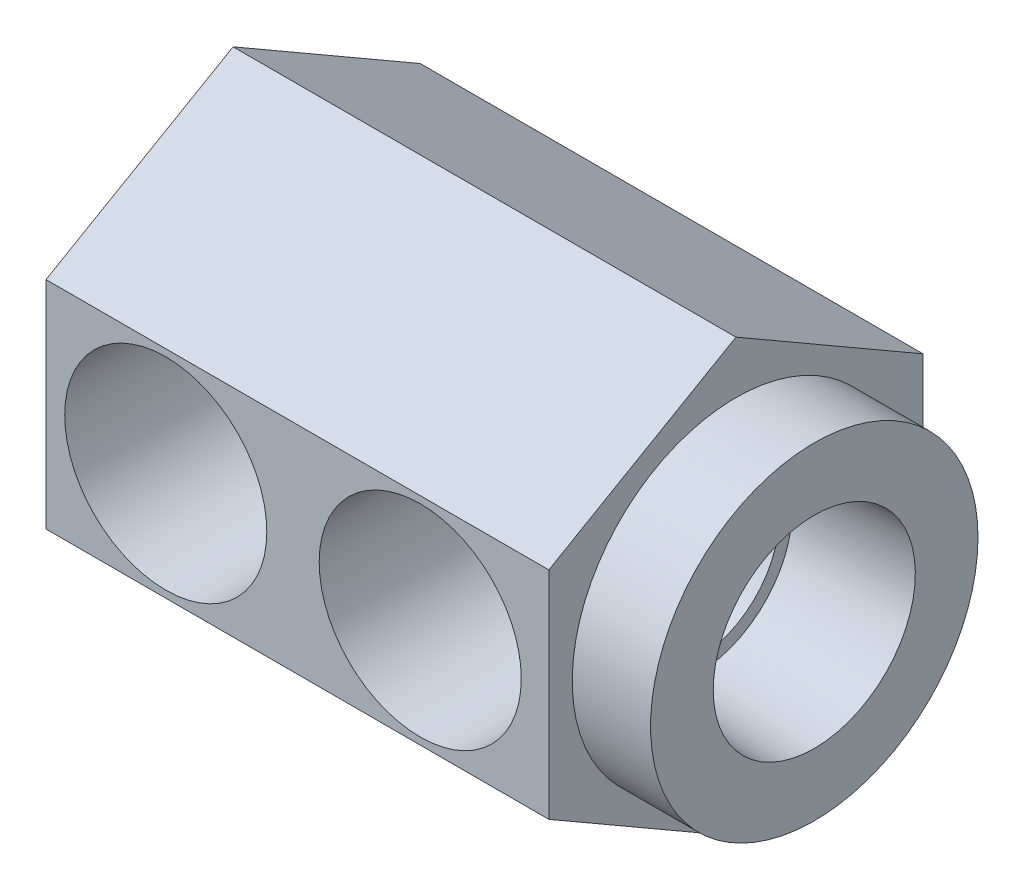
from build123d import *

# Parameters (mm, degrees)
BOSS_EXTRUDE1_DEPTH                 = 34.13125
SKETCH3_R                           = 11.1125
BOSS_EXTRUDE2_DEPTH                 = 5.31622
F_1_4_NPT_TAPPED_HOLE2_AT_2_COUNT   = 2
F_1_4_NPT_TAPPED_HOLE2_AT_2_PITCH   = 17.272
F_7_32_0_21875_DIAMETER_HOLE1_D     = 5.55625
F_7_32_0_21875_DIAMETER_HOLE1_DEPTH = 31.75
F_7_32_0_21875_DIAMETER_HOLE1_TIP   = 1.669265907
F_1_4_0_25_DIAMETER_HOLE1_D         = 6.35
F_1_4_0_25_DIAMETER_HOLE1_DEPTH     = 27.432
F_1_4_0_25_DIAMETER_HOLE1_TIP       = 1.907732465


with BuildPart() as part:
    # Sketch2 → Boss-Extrude1 (new body)
    with BuildSketch(Plane(origin=(0, 0, 0), x_dir=(0, 0, -1), z_dir=(1, 0, 0))):
        Polygon((-12.7, -7.332348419), (0, -14.664696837), (12.7, -7.332348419), (12.7, 7.332348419), (0, 14.664696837), (-12.7, 7.332348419), align=None)
    extrude(amount=BOSS_EXTRUDE1_DEPTH)

    # Sketch3 → Boss-Extrude2 (add)
    with BuildSketch(Plane(origin=(34.13125, 0, 0), x_dir=(0, 0, -1), z_dir=(1, 0, 0))):
        Circle(SKETCH3_R)
    extrude(amount=BOSS_EXTRUDE2_DEPTH)

    # Sketch4 → Cut-Revolve1 (revolve, cut)
    with BuildSketch(Plane(origin=(0, 0, 0), x_dir=(1, 0, 0), z_dir=(0, 1, 0)), mode=Mode.PRIVATE) as cut_revolve1_sk:
        Polygon((39.44747, 6.85927), (31.50997, 6.443283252), (31.50997, 5.55625), (29.92247, 5.55625), (29.92247, 0), (39.44747, 0), align=None)
    revolve(cut_revolve1_sk.sketch.rotate(Axis((-12.216170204, 0, 0), (1, 0, 0)), 180), axis=Axis((-12.216170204, 0, 0), (1, 0, 0)), mode=Mode.SUBTRACT)

    # Sketch5 → 1_4 NPT Tapped Hole1 (revolve, cut)
    with BuildSketch(Plane(origin=(8.128, 0, -12.7), x_dir=(0, 1, 0), z_dir=(1, 0, 0))):
        Polygon((0, 0), (0, 20.411147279), (5.5626, 17.0688), (5.5626, 10.0203), (6.557978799, 10.0203), (6.858, 0), align=None)
    revolve(axis=Axis((8.128, 0, -19.05), (0, 0, 1)), mode=Mode.SUBTRACT)

    # Sketch7 → 1_4 NPT Tapped Hole2 (revolve, cut)
    with BuildSketch(Plane(origin=(8.128, 0, 12.7), x_dir=(0, -1, 0), z_dir=(1, 0, 0))):
        Polygon((0, 0), (0, 20.411147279), (5.5626, 17.0688), (5.5626, 10.0203), (6.557978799, 10.0203), (6.858, 0), align=None)
    f_1_4_npt_tapped_hole2 = revolve(axis=Axis((8.128, 0, 19.05), (0, 0, -1)), mode=Mode.SUBTRACT)

    # 1_4 NPT Tapped Hole2 at 2: 1_4 NPT Tapped Hole2 ×2
    with Locations(*[(i * F_1_4_NPT_TAPPED_HOLE2_AT_2_PITCH, 0, 0) for i in range(1, F_1_4_NPT_TAPPED_HOLE2_AT_2_COUNT)]):
        add(f_1_4_npt_tapped_hole2, mode=Mode.SUBTRACT)

    # 7_32 _0.21875_ Diameter Hole1
    with Locations(Plane(origin=(39.44747, 0, 0), x_dir=(0, 0, -1), z_dir=(1, 0, 0))):
        with Locations((0, 0)):
            Hole(F_7_32_0_21875_DIAMETER_HOLE1_D / 2, depth=F_7_32_0_21875_DIAMETER_HOLE1_DEPTH)
            with Locations((0, 0, -(F_7_32_0_21875_DIAMETER_HOLE1_DEPTH + F_7_32_0_21875_DIAMETER_HOLE1_TIP / 2))):  # 118° drill point
                Cone(0, F_7_32_0_21875_DIAMETER_HOLE1_D / 2, F_7_32_0_21875_DIAMETER_HOLE1_TIP, mode=Mode.SUBTRACT)

    # 1_4 _0.25_ Diameter Hole1
    with Locations(Plane(origin=(39.44747, 0, 0), x_dir=(0, 0, -1), z_dir=(1, 0, 0))):
        with Locations((0, 0)):
            Hole(F_1_4_0_25_DIAMETER_HOLE1_D / 2, depth=F_1_4_0_25_DIAMETER_HOLE1_DEPTH)
            with Locations((0, 0, -(F_1_4_0_25_DIAMETER_HOLE1_DEPTH + F_1_4_0_25_DIAMETER_HOLE1_TIP / 2))):  # 118° drill point
                Cone(0, F_1_4_0_25_DIAMETER_HOLE1_D / 2, F_1_4_0_25_DIAMETER_HOLE1_TIP, mode=Mode.SUBTRACT)


solid = part.part
